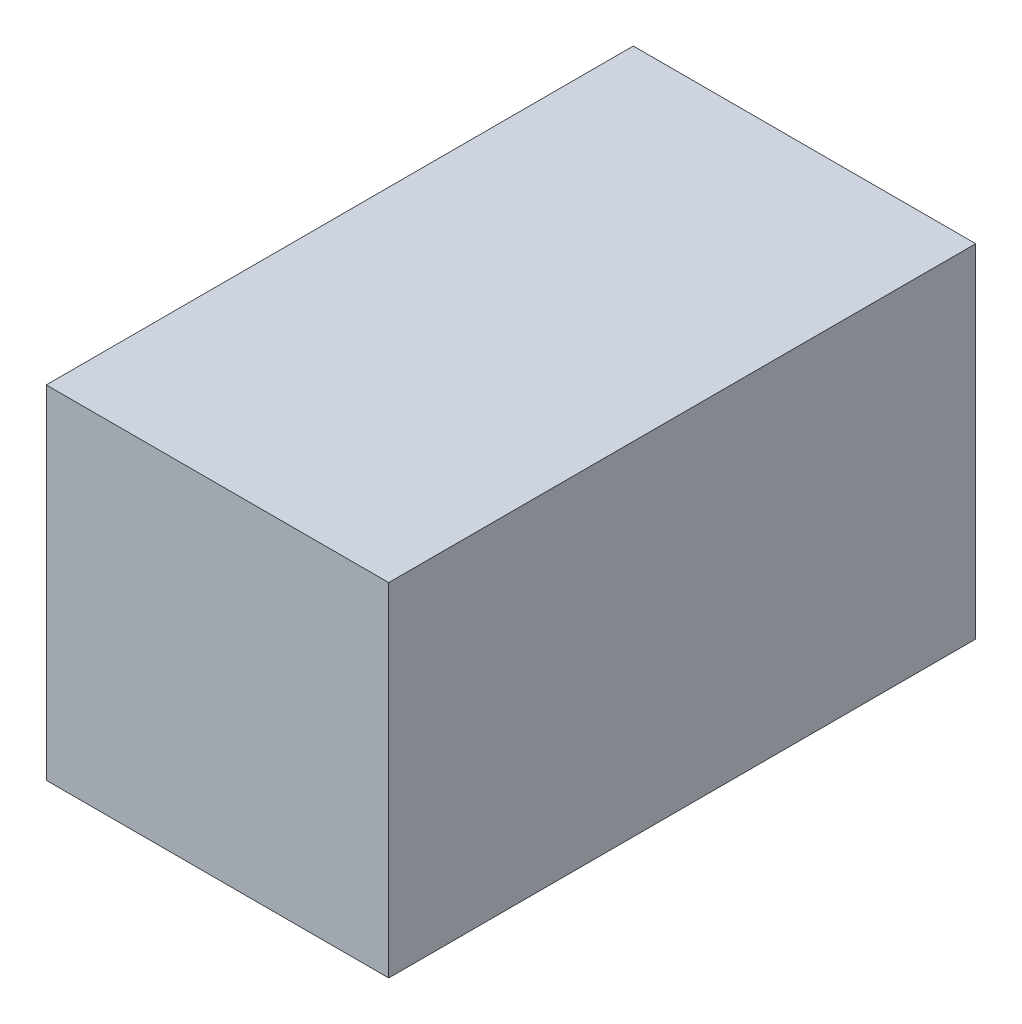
from build123d import *

# Parameters (mm, degrees)
SKETCH1_W           = 177.8
SKETCH1_H           = 177.8
BOSS_EXTRUDE1_DEPTH = 304.8


with BuildPart() as part:
    # Sketch1 → Boss-Extrude1 (new body)
    with BuildSketch(Plane.XY):
        Rectangle(SKETCH1_W, SKETCH1_H)
    extrude(amount=BOSS_EXTRUDE1_DEPTH)


solid = part.part
